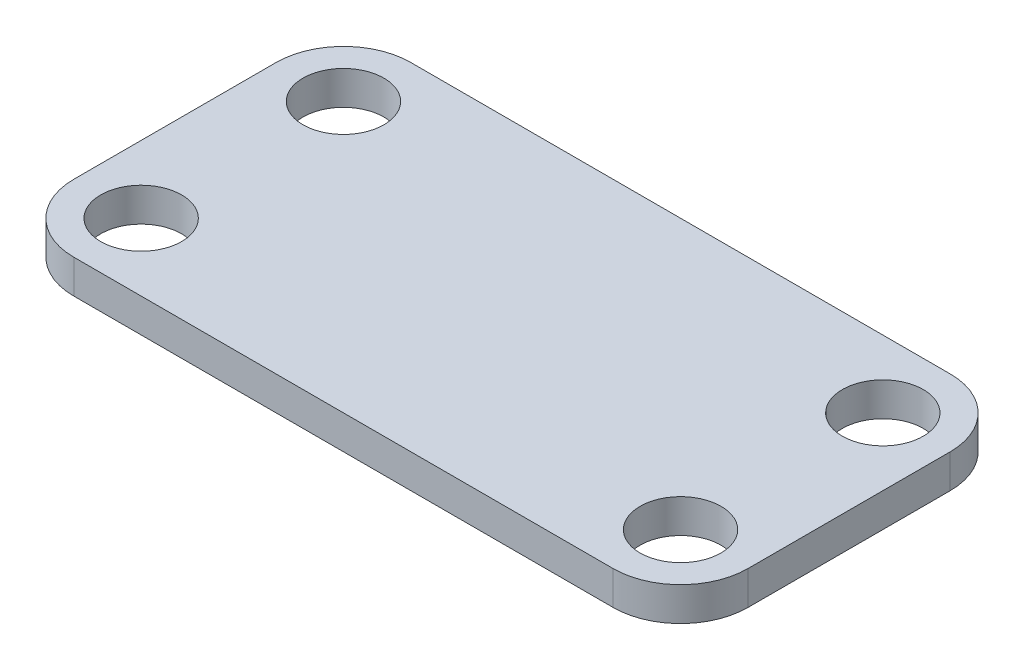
ISO-10303-21;
HEADER;
FILE_DESCRIPTION(('STEP AP214'),'2;1');
FILE_NAME('part.step','',(''),(''),'','','');
FILE_SCHEMA(('AUTOMOTIVE_DESIGN { 1 0 10303 214 1 1 1 1 }'));
ENDSEC;
DATA;
#1=APPLICATION_CONTEXT('core data for automotive mechanical design processes');
#2=APPLICATION_PROTOCOL_DEFINITION('international standard','automotive_design',2000,#1);
#3=PRODUCT_CONTEXT('',#1,'mechanical');
#4=PRODUCT('Part','Part','',(#3));
#5=PRODUCT_RELATED_PRODUCT_CATEGORY('part','',(#4));
#6=PRODUCT_DEFINITION_FORMATION('','',#4);
#7=PRODUCT_DEFINITION_CONTEXT('part definition',#1,'design');
#8=PRODUCT_DEFINITION('design','',#6,#7);
#9=PRODUCT_DEFINITION_SHAPE('','',#8);
#10=(LENGTH_UNIT() NAMED_UNIT(*) SI_UNIT(.MILLI.,.METRE.));
#11=(NAMED_UNIT(*) PLANE_ANGLE_UNIT() SI_UNIT($,.RADIAN.));
#12=(NAMED_UNIT(*) SI_UNIT($,.STERADIAN.) SOLID_ANGLE_UNIT());
#13=UNCERTAINTY_MEASURE_WITH_UNIT(LENGTH_MEASURE(1.E-05),#10,'distance_accuracy_value','');
#14=(GEOMETRIC_REPRESENTATION_CONTEXT(3) GLOBAL_UNCERTAINTY_ASSIGNED_CONTEXT((#13)) GLOBAL_UNIT_ASSIGNED_CONTEXT((#10,
#11,#12)) REPRESENTATION_CONTEXT('',''));
#15=CARTESIAN_POINT('',(0.,0.,0.));
#16=DIRECTION('',(0.,0.,1.));
#17=DIRECTION('',(1.,0.,0.));
#18=AXIS2_PLACEMENT_3D('',#15,#16,#17);
#19=CARTESIAN_POINT('',(-40.,5.,-15.));
#20=DIRECTION('',(0.,1.,0.));
#21=DIRECTION('',(0.,0.,1.));
#22=AXIS2_PLACEMENT_3D('',#19,#20,#21);
#23=PLANE('',#22);
#24=CARTESIAN_POINT('',(40.,5.,-15.));
#25=DIRECTION('',(0.,1.,0.));
#26=DIRECTION('',(0.,0.,1.));
#27=AXIS2_PLACEMENT_3D('',#24,#25,#26);
#28=CIRCLE('',#27,6.);
#29=CARTESIAN_POINT('',(40.,5.,-9.));
#30=VERTEX_POINT('',#29);
#31=EDGE_CURVE('E231',#30,#30,#28,.T.);
#32=ORIENTED_EDGE('',*,*,#31,.F.);
#33=EDGE_LOOP('',(#32));
#34=FACE_BOUND('',#33,.T.);
#35=CARTESIAN_POINT('',(-40.,5.,-15.));
#36=DIRECTION('',(0.,1.,0.));
#37=DIRECTION('',(0.,0.,1.));
#38=AXIS2_PLACEMENT_3D('',#35,#36,#37);
#39=CIRCLE('',#38,6.);
#40=CARTESIAN_POINT('',(-40.,5.,-9.));
#41=VERTEX_POINT('',#40);
#42=EDGE_CURVE('E113',#41,#41,#39,.T.);
#43=ORIENTED_EDGE('',*,*,#42,.F.);
#44=EDGE_LOOP('',(#43));
#45=FACE_BOUND('',#44,.T.);
#46=CARTESIAN_POINT('',(-40.,5.,-15.));
#47=DIRECTION('',(0.,1.,0.));
#48=DIRECTION('',(0.,0.,1.));
#49=AXIS2_PLACEMENT_3D('',#46,#47,#48);
#50=CIRCLE('',#49,10.);
#51=CARTESIAN_POINT('',(-39.9999999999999,5.,-25.));
#52=VERTEX_POINT('',#51);
#53=CARTESIAN_POINT('',(-50.,5.,-14.9999999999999));
#54=VERTEX_POINT('',#53);
#55=EDGE_CURVE('E131',#52,#54,#50,.T.);
#56=ORIENTED_EDGE('',*,*,#55,.T.);
#57=DIRECTION('',(0.,0.,1.));
#58=VECTOR('',#57,1.);
#59=CARTESIAN_POINT('',(-50.,5.,-14.9999999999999));
#60=LINE('',#59,#58);
#61=CARTESIAN_POINT('',(-50.,5.,14.9999999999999));
#62=VERTEX_POINT('',#61);
#63=EDGE_CURVE('E108',#54,#62,#60,.T.);
#64=ORIENTED_EDGE('',*,*,#63,.T.);
#65=CARTESIAN_POINT('',(-40.,5.,15.));
#66=DIRECTION('',(0.,1.,0.));
#67=DIRECTION('',(0.,0.,1.));
#68=AXIS2_PLACEMENT_3D('',#65,#66,#67);
#69=CIRCLE('',#68,10.);
#70=CARTESIAN_POINT('',(-39.9999999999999,5.,25.));
#71=VERTEX_POINT('',#70);
#72=EDGE_CURVE('E134',#62,#71,#69,.T.);
#73=ORIENTED_EDGE('',*,*,#72,.T.);
#74=DIRECTION('',(1.,0.,0.));
#75=VECTOR('',#74,1.);
#76=CARTESIAN_POINT('',(-39.9999999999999,5.,25.));
#77=LINE('',#76,#75);
#78=CARTESIAN_POINT('',(39.9999999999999,5.,25.));
#79=VERTEX_POINT('',#78);
#80=EDGE_CURVE('E136',#71,#79,#77,.T.);
#81=ORIENTED_EDGE('',*,*,#80,.T.);
#82=CARTESIAN_POINT('',(40.,5.,15.));
#83=DIRECTION('',(0.,1.,0.));
#84=DIRECTION('',(0.,0.,1.));
#85=AXIS2_PLACEMENT_3D('',#82,#83,#84);
#86=CIRCLE('',#85,10.);
#87=CARTESIAN_POINT('',(50.,5.,14.9999999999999));
#88=VERTEX_POINT('',#87);
#89=EDGE_CURVE('E138',#79,#88,#86,.T.);
#90=ORIENTED_EDGE('',*,*,#89,.T.);
#91=DIRECTION('',(0.,0.,-1.));
#92=VECTOR('',#91,1.);
#93=CARTESIAN_POINT('',(50.,5.,-14.9999999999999));
#94=LINE('',#93,#92);
#95=CARTESIAN_POINT('',(50.,5.,-14.9999999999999));
#96=VERTEX_POINT('',#95);
#97=EDGE_CURVE('E140',#88,#96,#94,.T.);
#98=ORIENTED_EDGE('',*,*,#97,.T.);
#99=CARTESIAN_POINT('',(40.,5.,-15.));
#100=DIRECTION('',(0.,1.,0.));
#101=DIRECTION('',(0.,0.,-1.));
#102=AXIS2_PLACEMENT_3D('',#99,#100,#101);
#103=CIRCLE('',#102,10.);
#104=CARTESIAN_POINT('',(39.9999999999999,5.,-25.));
#105=VERTEX_POINT('',#104);
#106=EDGE_CURVE('E49',#96,#105,#103,.T.);
#107=ORIENTED_EDGE('',*,*,#106,.T.);
#108=DIRECTION('',(-1.,0.,0.));
#109=VECTOR('',#108,1.);
#110=CARTESIAN_POINT('',(-39.9999999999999,5.,-25.));
#111=LINE('',#110,#109);
#112=EDGE_CURVE('E44',#105,#52,#111,.T.);
#113=ORIENTED_EDGE('',*,*,#112,.T.);
#114=EDGE_LOOP('',(#56,#64,#73,#81,#90,#98,#107,#113));
#115=FACE_BOUND('',#114,.T.);
#116=CARTESIAN_POINT('',(-40.,5.,15.));
#117=DIRECTION('',(0.,1.,0.));
#118=DIRECTION('',(0.,0.,1.));
#119=AXIS2_PLACEMENT_3D('',#116,#117,#118);
#120=CIRCLE('',#119,6.);
#121=CARTESIAN_POINT('',(-40.,5.,21.));
#122=VERTEX_POINT('',#121);
#123=EDGE_CURVE('E237',#122,#122,#120,.T.);
#124=ORIENTED_EDGE('',*,*,#123,.F.);
#125=EDGE_LOOP('',(#124));
#126=FACE_BOUND('',#125,.T.);
#127=CARTESIAN_POINT('',(40.,5.,15.));
#128=DIRECTION('',(0.,1.,0.));
#129=DIRECTION('',(0.,0.,1.));
#130=AXIS2_PLACEMENT_3D('',#127,#128,#129);
#131=CIRCLE('',#130,6.);
#132=CARTESIAN_POINT('',(40.,5.,21.));
#133=VERTEX_POINT('',#132);
#134=EDGE_CURVE('E220',#133,#133,#131,.T.);
#135=ORIENTED_EDGE('',*,*,#134,.F.);
#136=EDGE_LOOP('',(#135));
#137=FACE_BOUND('',#136,.T.);
#138=ADVANCED_FACE('F29',(#34,#45,#115,#126,#137),#23,.T.);
#139=CARTESIAN_POINT('',(-40.,0.,-15.));
#140=DIRECTION('',(0.,1.,0.));
#141=DIRECTION('',(0.,0.,1.));
#142=AXIS2_PLACEMENT_3D('',#139,#140,#141);
#143=PLANE('',#142);
#144=CARTESIAN_POINT('',(40.,0.,-15.));
#145=DIRECTION('',(0.,1.,0.));
#146=DIRECTION('',(0.,0.,1.));
#147=AXIS2_PLACEMENT_3D('',#144,#145,#146);
#148=CIRCLE('',#147,6.);
#149=CARTESIAN_POINT('',(40.,0.,-9.));
#150=VERTEX_POINT('',#149);
#151=EDGE_CURVE('E226',#150,#150,#148,.T.);
#152=ORIENTED_EDGE('',*,*,#151,.T.);
#153=EDGE_LOOP('',(#152));
#154=FACE_BOUND('',#153,.T.);
#155=CARTESIAN_POINT('',(-40.,0.,-15.));
#156=DIRECTION('',(0.,1.,0.));
#157=DIRECTION('',(0.,0.,1.));
#158=AXIS2_PLACEMENT_3D('',#155,#156,#157);
#159=CIRCLE('',#158,6.);
#160=CARTESIAN_POINT('',(-40.,0.,-9.));
#161=VERTEX_POINT('',#160);
#162=EDGE_CURVE('E116',#161,#161,#159,.T.);
#163=ORIENTED_EDGE('',*,*,#162,.T.);
#164=EDGE_LOOP('',(#163));
#165=FACE_BOUND('',#164,.T.);
#166=CARTESIAN_POINT('',(-40.,0.,-15.));
#167=DIRECTION('',(0.,1.,0.));
#168=DIRECTION('',(0.,0.,1.));
#169=AXIS2_PLACEMENT_3D('',#166,#167,#168);
#170=CIRCLE('',#169,10.);
#171=CARTESIAN_POINT('',(-39.9999999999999,0.,-25.));
#172=VERTEX_POINT('',#171);
#173=CARTESIAN_POINT('',(-50.,0.,-14.9999999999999));
#174=VERTEX_POINT('',#173);
#175=EDGE_CURVE('E99',#172,#174,#170,.T.);
#176=ORIENTED_EDGE('',*,*,#175,.F.);
#177=DIRECTION('',(-1.,0.,0.));
#178=VECTOR('',#177,1.);
#179=CARTESIAN_POINT('',(-39.9999999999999,0.,-25.));
#180=LINE('',#179,#178);
#181=CARTESIAN_POINT('',(39.9999999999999,0.,-25.));
#182=VERTEX_POINT('',#181);
#183=EDGE_CURVE('E129',#182,#172,#180,.T.);
#184=ORIENTED_EDGE('',*,*,#183,.F.);
#185=CARTESIAN_POINT('',(40.,0.,-15.));
#186=DIRECTION('',(0.,1.,0.));
#187=DIRECTION('',(0.,0.,-1.));
#188=AXIS2_PLACEMENT_3D('',#185,#186,#187);
#189=CIRCLE('',#188,10.);
#190=CARTESIAN_POINT('',(50.,0.,-14.9999999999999));
#191=VERTEX_POINT('',#190);
#192=EDGE_CURVE('E127',#191,#182,#189,.T.);
#193=ORIENTED_EDGE('',*,*,#192,.F.);
#194=DIRECTION('',(0.,0.,-1.));
#195=VECTOR('',#194,1.);
#196=CARTESIAN_POINT('',(50.,0.,-14.9999999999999));
#197=LINE('',#196,#195);
#198=CARTESIAN_POINT('',(50.,0.,14.9999999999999));
#199=VERTEX_POINT('',#198);
#200=EDGE_CURVE('E125',#199,#191,#197,.T.);
#201=ORIENTED_EDGE('',*,*,#200,.F.);
#202=CARTESIAN_POINT('',(40.,0.,15.));
#203=DIRECTION('',(0.,1.,0.));
#204=DIRECTION('',(0.,0.,1.));
#205=AXIS2_PLACEMENT_3D('',#202,#203,#204);
#206=CIRCLE('',#205,10.);
#207=CARTESIAN_POINT('',(39.9999999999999,0.,25.));
#208=VERTEX_POINT('',#207);
#209=EDGE_CURVE('E123',#208,#199,#206,.T.);
#210=ORIENTED_EDGE('',*,*,#209,.F.);
#211=DIRECTION('',(1.,0.,0.));
#212=VECTOR('',#211,1.);
#213=CARTESIAN_POINT('',(-39.9999999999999,0.,25.));
#214=LINE('',#213,#212);
#215=CARTESIAN_POINT('',(-39.9999999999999,0.,25.));
#216=VERTEX_POINT('',#215);
#217=EDGE_CURVE('E121',#216,#208,#214,.T.);
#218=ORIENTED_EDGE('',*,*,#217,.F.);
#219=CARTESIAN_POINT('',(-40.,0.,15.));
#220=DIRECTION('',(0.,1.,0.));
#221=DIRECTION('',(0.,0.,1.));
#222=AXIS2_PLACEMENT_3D('',#219,#220,#221);
#223=CIRCLE('',#222,10.);
#224=CARTESIAN_POINT('',(-50.,0.,14.9999999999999));
#225=VERTEX_POINT('',#224);
#226=EDGE_CURVE('E101',#225,#216,#223,.T.);
#227=ORIENTED_EDGE('',*,*,#226,.F.);
#228=DIRECTION('',(0.,0.,1.));
#229=VECTOR('',#228,1.);
#230=CARTESIAN_POINT('',(-50.,0.,-14.9999999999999));
#231=LINE('',#230,#229);
#232=EDGE_CURVE('E94',#174,#225,#231,.T.);
#233=ORIENTED_EDGE('',*,*,#232,.F.);
#234=EDGE_LOOP('',(#176,#184,#193,#201,#210,#218,#227,#233));
#235=FACE_BOUND('',#234,.T.);
#236=CARTESIAN_POINT('',(-40.,0.,15.));
#237=DIRECTION('',(0.,1.,0.));
#238=DIRECTION('',(0.,0.,1.));
#239=AXIS2_PLACEMENT_3D('',#236,#237,#238);
#240=CIRCLE('',#239,6.);
#241=CARTESIAN_POINT('',(-40.,0.,21.));
#242=VERTEX_POINT('',#241);
#243=EDGE_CURVE('E234',#242,#242,#240,.T.);
#244=ORIENTED_EDGE('',*,*,#243,.T.);
#245=EDGE_LOOP('',(#244));
#246=FACE_BOUND('',#245,.T.);
#247=CARTESIAN_POINT('',(40.,0.,15.));
#248=DIRECTION('',(0.,1.,0.));
#249=DIRECTION('',(0.,0.,1.));
#250=AXIS2_PLACEMENT_3D('',#247,#248,#249);
#251=CIRCLE('',#250,6.);
#252=CARTESIAN_POINT('',(40.,0.,21.));
#253=VERTEX_POINT('',#252);
#254=EDGE_CURVE('E223',#253,#253,#251,.T.);
#255=ORIENTED_EDGE('',*,*,#254,.T.);
#256=EDGE_LOOP('',(#255));
#257=FACE_BOUND('',#256,.T.);
#258=ADVANCED_FACE('F95',(#154,#165,#235,#246,#257),#143,.F.);
#259=CARTESIAN_POINT('',(-40.,5.,-15.));
#260=DIRECTION('',(0.,-1.,0.));
#261=DIRECTION('',(0.,0.,-1.));
#262=AXIS2_PLACEMENT_3D('',#259,#260,#261);
#263=CYLINDRICAL_SURFACE('',#262,10.);
#264=ORIENTED_EDGE('',*,*,#175,.T.);
#265=DIRECTION('',(0.,-1.,0.));
#266=VECTOR('',#265,1.);
#267=CARTESIAN_POINT('',(-50.,5.,-14.9999999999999));
#268=LINE('',#267,#266);
#269=EDGE_CURVE('E11',#54,#174,#268,.T.);
#270=ORIENTED_EDGE('',*,*,#269,.F.);
#271=ORIENTED_EDGE('',*,*,#55,.F.);
#272=DIRECTION('',(0.,-1.,0.));
#273=VECTOR('',#272,1.);
#274=CARTESIAN_POINT('',(-39.9999999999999,5.,-25.));
#275=LINE('',#274,#273);
#276=EDGE_CURVE('E112',#52,#172,#275,.T.);
#277=ORIENTED_EDGE('',*,*,#276,.T.);
#278=EDGE_LOOP('',(#264,#270,#271,#277));
#279=FACE_BOUND('',#278,.T.);
#280=ADVANCED_FACE('F31',(#279),#263,.T.);
#281=CARTESIAN_POINT('',(-50.,5.,-14.9999999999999));
#282=DIRECTION('',(1.,0.,0.));
#283=DIRECTION('',(0.,0.,-1.));
#284=AXIS2_PLACEMENT_3D('',#281,#282,#283);
#285=PLANE('',#284);
#286=ORIENTED_EDGE('',*,*,#232,.T.);
#287=DIRECTION('',(0.,-1.,0.));
#288=VECTOR('',#287,1.);
#289=CARTESIAN_POINT('',(-50.,5.,14.9999999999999));
#290=LINE('',#289,#288);
#291=EDGE_CURVE('E37',#62,#225,#290,.T.);
#292=ORIENTED_EDGE('',*,*,#291,.F.);
#293=ORIENTED_EDGE('',*,*,#63,.F.);
#294=ORIENTED_EDGE('',*,*,#269,.T.);
#295=EDGE_LOOP('',(#286,#292,#293,#294));
#296=FACE_BOUND('',#295,.T.);
#297=ADVANCED_FACE('F107',(#296),#285,.F.);
#298=CARTESIAN_POINT('',(-40.,5.,15.));
#299=DIRECTION('',(0.,-1.,0.));
#300=DIRECTION('',(0.,0.,-1.));
#301=AXIS2_PLACEMENT_3D('',#298,#299,#300);
#302=CYLINDRICAL_SURFACE('',#301,10.);
#303=ORIENTED_EDGE('',*,*,#226,.T.);
#304=DIRECTION('',(0.,-1.,0.));
#305=VECTOR('',#304,1.);
#306=CARTESIAN_POINT('',(-39.9999999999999,5.,25.));
#307=LINE('',#306,#305);
#308=EDGE_CURVE('E157',#71,#216,#307,.T.);
#309=ORIENTED_EDGE('',*,*,#308,.F.);
#310=ORIENTED_EDGE('',*,*,#72,.F.);
#311=ORIENTED_EDGE('',*,*,#291,.T.);
#312=EDGE_LOOP('',(#303,#309,#310,#311));
#313=FACE_BOUND('',#312,.T.);
#314=ADVANCED_FACE('F161',(#313),#302,.T.);
#315=CARTESIAN_POINT('',(-39.9999999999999,5.,25.));
#316=DIRECTION('',(0.,0.,-1.));
#317=DIRECTION('',(-1.,0.,0.));
#318=AXIS2_PLACEMENT_3D('',#315,#316,#317);
#319=PLANE('',#318);
#320=ORIENTED_EDGE('',*,*,#217,.T.);
#321=DIRECTION('',(0.,-1.,0.));
#322=VECTOR('',#321,1.);
#323=CARTESIAN_POINT('',(39.9999999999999,5.,25.));
#324=LINE('',#323,#322);
#325=EDGE_CURVE('E154',#79,#208,#324,.T.);
#326=ORIENTED_EDGE('',*,*,#325,.F.);
#327=ORIENTED_EDGE('',*,*,#80,.F.);
#328=ORIENTED_EDGE('',*,*,#308,.T.);
#329=EDGE_LOOP('',(#320,#326,#327,#328));
#330=FACE_BOUND('',#329,.T.);
#331=ADVANCED_FACE('F169',(#330),#319,.F.);
#332=CARTESIAN_POINT('',(40.,5.,15.));
#333=DIRECTION('',(0.,-1.,0.));
#334=DIRECTION('',(0.,0.,-1.));
#335=AXIS2_PLACEMENT_3D('',#332,#333,#334);
#336=CYLINDRICAL_SURFACE('',#335,10.);
#337=ORIENTED_EDGE('',*,*,#209,.T.);
#338=DIRECTION('',(0.,-1.,0.));
#339=VECTOR('',#338,1.);
#340=CARTESIAN_POINT('',(50.,5.,14.9999999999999));
#341=LINE('',#340,#339);
#342=EDGE_CURVE('E151',#88,#199,#341,.T.);
#343=ORIENTED_EDGE('',*,*,#342,.F.);
#344=ORIENTED_EDGE('',*,*,#89,.F.);
#345=ORIENTED_EDGE('',*,*,#325,.T.);
#346=EDGE_LOOP('',(#337,#343,#344,#345));
#347=FACE_BOUND('',#346,.T.);
#348=ADVANCED_FACE('F172',(#347),#336,.T.);
#349=CARTESIAN_POINT('',(50.,5.,-14.9999999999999));
#350=DIRECTION('',(-1.,0.,0.));
#351=DIRECTION('',(0.,0.,1.));
#352=AXIS2_PLACEMENT_3D('',#349,#350,#351);
#353=PLANE('',#352);
#354=ORIENTED_EDGE('',*,*,#200,.T.);
#355=DIRECTION('',(0.,-1.,0.));
#356=VECTOR('',#355,1.);
#357=CARTESIAN_POINT('',(50.,5.,-14.9999999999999));
#358=LINE('',#357,#356);
#359=EDGE_CURVE('E148',#96,#191,#358,.T.);
#360=ORIENTED_EDGE('',*,*,#359,.F.);
#361=ORIENTED_EDGE('',*,*,#97,.F.);
#362=ORIENTED_EDGE('',*,*,#342,.T.);
#363=EDGE_LOOP('',(#354,#360,#361,#362));
#364=FACE_BOUND('',#363,.T.);
#365=ADVANCED_FACE('F177',(#364),#353,.F.);
#366=CARTESIAN_POINT('',(40.,5.,-15.));
#367=DIRECTION('',(0.,-1.,0.));
#368=DIRECTION('',(0.,0.,-1.));
#369=AXIS2_PLACEMENT_3D('',#366,#367,#368);
#370=CYLINDRICAL_SURFACE('',#369,10.);
#371=ORIENTED_EDGE('',*,*,#192,.T.);
#372=DIRECTION('',(0.,-1.,0.));
#373=VECTOR('',#372,1.);
#374=CARTESIAN_POINT('',(39.9999999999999,5.,-25.));
#375=LINE('',#374,#373);
#376=EDGE_CURVE('E145',#105,#182,#375,.T.);
#377=ORIENTED_EDGE('',*,*,#376,.F.);
#378=ORIENTED_EDGE('',*,*,#106,.F.);
#379=ORIENTED_EDGE('',*,*,#359,.T.);
#380=EDGE_LOOP('',(#371,#377,#378,#379));
#381=FACE_BOUND('',#380,.T.);
#382=ADVANCED_FACE('F180',(#381),#370,.T.);
#383=CARTESIAN_POINT('',(-39.9999999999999,5.,-25.));
#384=DIRECTION('',(0.,0.,1.));
#385=DIRECTION('',(1.,0.,0.));
#386=AXIS2_PLACEMENT_3D('',#383,#384,#385);
#387=PLANE('',#386);
#388=ORIENTED_EDGE('',*,*,#183,.T.);
#389=ORIENTED_EDGE('',*,*,#276,.F.);
#390=ORIENTED_EDGE('',*,*,#112,.F.);
#391=ORIENTED_EDGE('',*,*,#376,.T.);
#392=EDGE_LOOP('',(#388,#389,#390,#391));
#393=FACE_BOUND('',#392,.T.);
#394=ADVANCED_FACE('F182',(#393),#387,.F.);
#395=CARTESIAN_POINT('',(-40.,5.,-15.));
#396=DIRECTION('',(0.,-1.,0.));
#397=DIRECTION('',(0.,0.,-1.));
#398=AXIS2_PLACEMENT_3D('',#395,#396,#397);
#399=CYLINDRICAL_SURFACE('',#398,6.);
#400=ORIENTED_EDGE('',*,*,#42,.T.);
#401=EDGE_LOOP('',(#400));
#402=FACE_BOUND('',#401,.T.);
#403=ORIENTED_EDGE('',*,*,#162,.F.);
#404=EDGE_LOOP('',(#403));
#405=FACE_BOUND('',#404,.T.);
#406=ADVANCED_FACE('F184',(#402,#405),#399,.F.);
#407=CARTESIAN_POINT('',(-40.,5.,15.));
#408=DIRECTION('',(0.,-1.,0.));
#409=DIRECTION('',(0.,0.,-1.));
#410=AXIS2_PLACEMENT_3D('',#407,#408,#409);
#411=CYLINDRICAL_SURFACE('',#410,6.);
#412=ORIENTED_EDGE('',*,*,#123,.T.);
#413=EDGE_LOOP('',(#412));
#414=FACE_BOUND('',#413,.T.);
#415=ORIENTED_EDGE('',*,*,#243,.F.);
#416=EDGE_LOOP('',(#415));
#417=FACE_BOUND('',#416,.T.);
#418=ADVANCED_FACE('F190',(#414,#417),#411,.F.);
#419=CARTESIAN_POINT('',(40.,5.,-15.));
#420=DIRECTION('',(0.,-1.,0.));
#421=DIRECTION('',(0.,0.,-1.));
#422=AXIS2_PLACEMENT_3D('',#419,#420,#421);
#423=CYLINDRICAL_SURFACE('',#422,6.);
#424=ORIENTED_EDGE('',*,*,#31,.T.);
#425=EDGE_LOOP('',(#424));
#426=FACE_BOUND('',#425,.T.);
#427=ORIENTED_EDGE('',*,*,#151,.F.);
#428=EDGE_LOOP('',(#427));
#429=FACE_BOUND('',#428,.T.);
#430=ADVANCED_FACE('F207',(#426,#429),#423,.F.);
#431=CARTESIAN_POINT('',(40.,5.,15.));
#432=DIRECTION('',(0.,-1.,0.));
#433=DIRECTION('',(0.,0.,-1.));
#434=AXIS2_PLACEMENT_3D('',#431,#432,#433);
#435=CYLINDRICAL_SURFACE('',#434,6.);
#436=ORIENTED_EDGE('',*,*,#134,.T.);
#437=EDGE_LOOP('',(#436));
#438=FACE_BOUND('',#437,.T.);
#439=ORIENTED_EDGE('',*,*,#254,.F.);
#440=EDGE_LOOP('',(#439));
#441=FACE_BOUND('',#440,.T.);
#442=ADVANCED_FACE('F211',(#438,#441),#435,.F.);
#443=CLOSED_SHELL('',(#138,#258,#280,#297,#314,#331,#348,#365,#382,#394,#406,#418,#430,#442));
#444=MANIFOLD_SOLID_BREP('B2',#443);
#445=ADVANCED_BREP_SHAPE_REPRESENTATION('',(#18,#444),#14);
#446=SHAPE_DEFINITION_REPRESENTATION(#9,#445);
ENDSEC;
END-ISO-10303-21;
